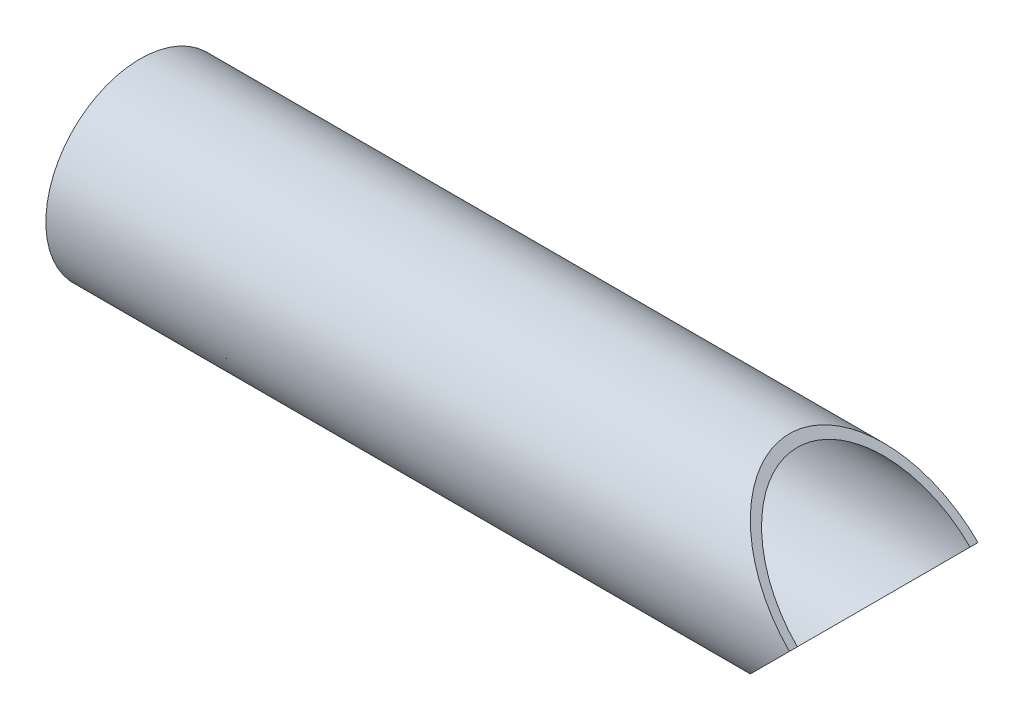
ISO-10303-21;
HEADER;
FILE_DESCRIPTION(('STEP AP214'),'2;1');
FILE_NAME('part.step','',(''),(''),'','','');
FILE_SCHEMA(('AUTOMOTIVE_DESIGN { 1 0 10303 214 1 1 1 1 }'));
ENDSEC;
DATA;
#1=APPLICATION_CONTEXT('core data for automotive mechanical design processes');
#2=APPLICATION_PROTOCOL_DEFINITION('international standard','automotive_design',2000,#1);
#3=PRODUCT_CONTEXT('',#1,'mechanical');
#4=PRODUCT('Part','Part','',(#3));
#5=PRODUCT_RELATED_PRODUCT_CATEGORY('part','',(#4));
#6=PRODUCT_DEFINITION_FORMATION('','',#4);
#7=PRODUCT_DEFINITION_CONTEXT('part definition',#1,'design');
#8=PRODUCT_DEFINITION('design','',#6,#7);
#9=PRODUCT_DEFINITION_SHAPE('','',#8);
#10=(LENGTH_UNIT() NAMED_UNIT(*) SI_UNIT(.MILLI.,.METRE.));
#11=(NAMED_UNIT(*) PLANE_ANGLE_UNIT() SI_UNIT($,.RADIAN.));
#12=(NAMED_UNIT(*) SI_UNIT($,.STERADIAN.) SOLID_ANGLE_UNIT());
#13=UNCERTAINTY_MEASURE_WITH_UNIT(LENGTH_MEASURE(1.E-05),#10,'distance_accuracy_value','');
#14=(GEOMETRIC_REPRESENTATION_CONTEXT(3) GLOBAL_UNCERTAINTY_ASSIGNED_CONTEXT((#13)) GLOBAL_UNIT_ASSIGNED_CONTEXT((#10,
#11,#12)) REPRESENTATION_CONTEXT('',''));
#15=CARTESIAN_POINT('',(0.,0.,0.));
#16=DIRECTION('',(0.,0.,1.));
#17=DIRECTION('',(1.,0.,0.));
#18=AXIS2_PLACEMENT_3D('',#15,#16,#17);
#19=CARTESIAN_POINT('',(0.,0.,0.));
#20=DIRECTION('',(1.,0.,0.));
#21=DIRECTION('',(0.,0.,-1.));
#22=AXIS2_PLACEMENT_3D('',#19,#20,#21);
#23=CYLINDRICAL_SURFACE('',#22,38.05);
#24=CARTESIAN_POINT('',(300.,0.,0.));
#25=DIRECTION('',(-0.707106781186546,-0.707106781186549,0.));
#26=DIRECTION('',(0.707106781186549,-0.707106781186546,0.));
#27=AXIS2_PLACEMENT_3D('',#24,#25,#26);
#28=ELLIPSE('',#27,53.8108260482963,38.05);
#29=CARTESIAN_POINT('',(300.,0.,-38.05));
#30=VERTEX_POINT('',#29);
#31=CARTESIAN_POINT('',(300.,0.,38.05));
#32=VERTEX_POINT('',#31);
#33=EDGE_CURVE('E65',#30,#32,#28,.F.);
#34=ORIENTED_EDGE('',*,*,#33,.F.);
#35=CARTESIAN_POINT('',(300.,0.,0.));
#36=DIRECTION('',(-0.707106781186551,0.707106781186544,0.));
#37=DIRECTION('',(0.707106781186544,0.707106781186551,0.));
#38=AXIS2_PLACEMENT_3D('',#35,#36,#37);
#39=ELLIPSE('',#38,53.810826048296,38.05);
#40=EDGE_CURVE('E61',#32,#30,#39,.F.);
#41=ORIENTED_EDGE('',*,*,#40,.F.);
#42=EDGE_LOOP('',(#34,#41));
#43=FACE_BOUND('',#42,.T.);
#44=CARTESIAN_POINT('',(0.,0.,0.));
#45=DIRECTION('',(1.,0.,0.));
#46=DIRECTION('',(0.,0.,-1.));
#47=AXIS2_PLACEMENT_3D('',#44,#45,#46);
#48=CIRCLE('',#47,38.05);
#49=CARTESIAN_POINT('',(0.,0.,-38.05));
#50=VERTEX_POINT('',#49);
#51=EDGE_CURVE('E75',#50,#50,#48,.T.);
#52=ORIENTED_EDGE('',*,*,#51,.T.);
#53=EDGE_LOOP('',(#52));
#54=FACE_BOUND('',#53,.T.);
#55=ADVANCED_FACE('F36',(#43,#54),#23,.T.);
#56=CARTESIAN_POINT('',(0.,0.,0.));
#57=DIRECTION('',(1.,0.,0.));
#58=DIRECTION('',(0.,0.,-1.));
#59=AXIS2_PLACEMENT_3D('',#56,#57,#58);
#60=PLANE('',#59);
#61=CARTESIAN_POINT('',(0.,0.,0.));
#62=DIRECTION('',(1.,0.,0.));
#63=DIRECTION('',(0.,0.,-1.));
#64=AXIS2_PLACEMENT_3D('',#61,#62,#63);
#65=CIRCLE('',#64,34.85);
#66=CARTESIAN_POINT('',(0.,0.,-34.85));
#67=VERTEX_POINT('',#66);
#68=EDGE_CURVE('E72',#67,#67,#65,.T.);
#69=ORIENTED_EDGE('',*,*,#68,.T.);
#70=EDGE_LOOP('',(#69));
#71=FACE_BOUND('',#70,.T.);
#72=ORIENTED_EDGE('',*,*,#51,.F.);
#73=EDGE_LOOP('',(#72));
#74=FACE_BOUND('',#73,.T.);
#75=ADVANCED_FACE('F82',(#71,#74),#60,.F.);
#76=CARTESIAN_POINT('',(0.,0.,0.));
#77=DIRECTION('',(1.,0.,0.));
#78=DIRECTION('',(0.,0.,-1.));
#79=AXIS2_PLACEMENT_3D('',#76,#77,#78);
#80=CYLINDRICAL_SURFACE('',#79,34.85);
#81=ORIENTED_EDGE('',*,*,#68,.F.);
#82=EDGE_LOOP('',(#81));
#83=FACE_BOUND('',#82,.T.);
#84=CARTESIAN_POINT('',(300.,0.,0.));
#85=DIRECTION('',(-0.707106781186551,0.707106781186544,0.));
#86=DIRECTION('',(0.707106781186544,0.707106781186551,0.));
#87=AXIS2_PLACEMENT_3D('',#84,#85,#86);
#88=ELLIPSE('',#87,49.2853426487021,34.85);
#89=CARTESIAN_POINT('',(300.,0.,34.85));
#90=VERTEX_POINT('',#89);
#91=CARTESIAN_POINT('',(300.,0.,-34.85));
#92=VERTEX_POINT('',#91);
#93=EDGE_CURVE('E43',#90,#92,#88,.F.);
#94=ORIENTED_EDGE('',*,*,#93,.T.);
#95=CARTESIAN_POINT('',(300.,0.,0.));
#96=DIRECTION('',(-0.707106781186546,-0.707106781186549,0.));
#97=DIRECTION('',(0.707106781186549,-0.707106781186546,0.));
#98=AXIS2_PLACEMENT_3D('',#95,#96,#97);
#99=ELLIPSE('',#98,49.2853426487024,34.85);
#100=EDGE_CURVE('E11',#92,#90,#99,.F.);
#101=ORIENTED_EDGE('',*,*,#100,.T.);
#102=EDGE_LOOP('',(#94,#101));
#103=FACE_BOUND('',#102,.T.);
#104=ADVANCED_FACE('F80',(#83,#103),#80,.F.);
#105=CARTESIAN_POINT('',(300.,0.,-40.));
#106=DIRECTION('',(-0.707106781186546,-0.707106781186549,0.));
#107=DIRECTION('',(0.707106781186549,-0.707106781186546,0.));
#108=AXIS2_PLACEMENT_3D('',#105,#106,#107);
#109=PLANE('',#108);
#110=ORIENTED_EDGE('',*,*,#33,.T.);
#111=DIRECTION('',(0.,0.,1.));
#112=VECTOR('',#111,1.);
#113=CARTESIAN_POINT('',(300.,0.,-40.));
#114=LINE('',#113,#112);
#115=EDGE_CURVE('E50',#90,#32,#114,.T.);
#116=ORIENTED_EDGE('',*,*,#115,.F.);
#117=ORIENTED_EDGE('',*,*,#100,.F.);
#118=EDGE_CURVE('E55',#30,#92,#114,.T.);
#119=ORIENTED_EDGE('',*,*,#118,.F.);
#120=EDGE_LOOP('',(#110,#116,#117,#119));
#121=FACE_BOUND('',#120,.T.);
#122=ADVANCED_FACE('F68',(#121),#109,.F.);
#123=CARTESIAN_POINT('',(300.,0.,-40.));
#124=DIRECTION('',(-0.707106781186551,0.707106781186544,0.));
#125=DIRECTION('',(-0.707106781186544,-0.707106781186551,0.));
#126=AXIS2_PLACEMENT_3D('',#123,#124,#125);
#127=PLANE('',#126);
#128=ORIENTED_EDGE('',*,*,#40,.T.);
#129=ORIENTED_EDGE('',*,*,#118,.T.);
#130=ORIENTED_EDGE('',*,*,#93,.F.);
#131=ORIENTED_EDGE('',*,*,#115,.T.);
#132=EDGE_LOOP('',(#128,#129,#130,#131));
#133=FACE_BOUND('',#132,.T.);
#134=ADVANCED_FACE('F62',(#133),#127,.F.);
#135=CLOSED_SHELL('',(#55,#75,#104,#122,#134));
#136=MANIFOLD_SOLID_BREP('B2',#135);
#137=ADVANCED_BREP_SHAPE_REPRESENTATION('',(#18,#136),#14);
#138=SHAPE_DEFINITION_REPRESENTATION(#9,#137);
ENDSEC;
END-ISO-10303-21;
